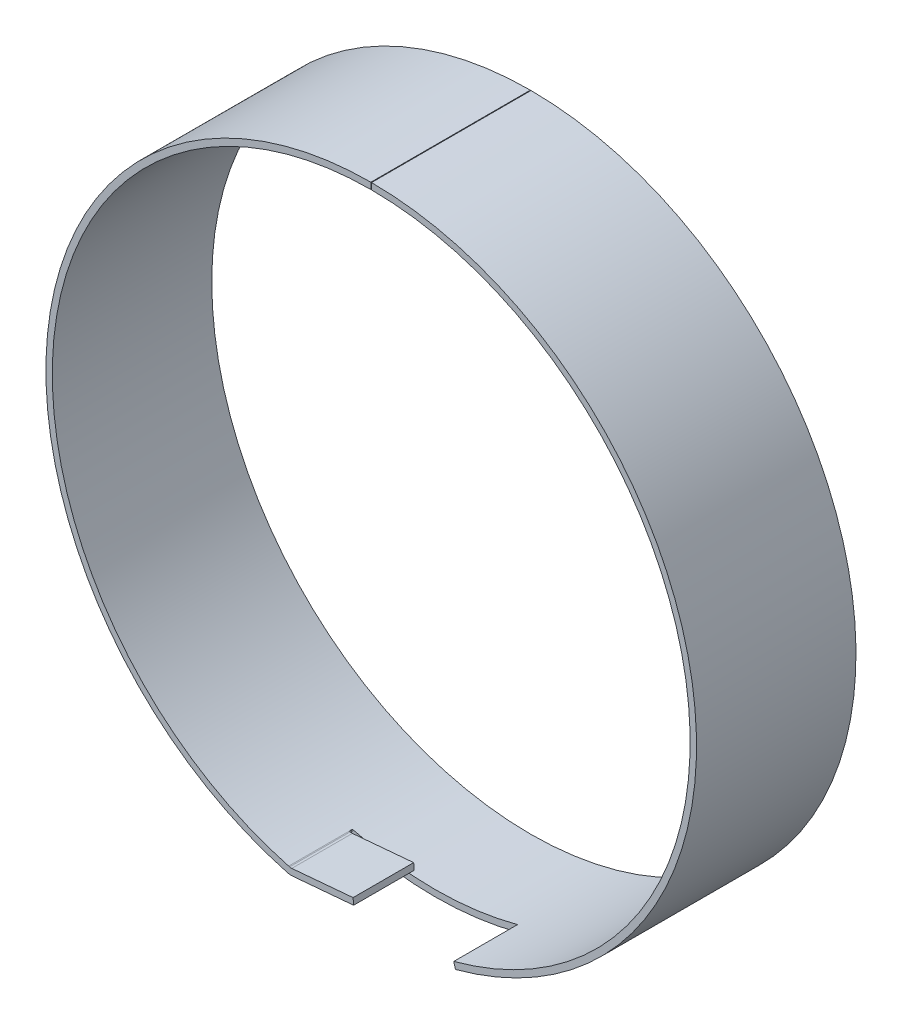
ISO-10303-21;
HEADER;
FILE_DESCRIPTION(('STEP AP214'),'2;1');
FILE_NAME('part.step','',(''),(''),'','','');
FILE_SCHEMA(('AUTOMOTIVE_DESIGN { 1 0 10303 214 1 1 1 1 }'));
ENDSEC;
DATA;
#1=APPLICATION_CONTEXT('core data for automotive mechanical design processes');
#2=APPLICATION_PROTOCOL_DEFINITION('international standard','automotive_design',2000,#1);
#3=PRODUCT_CONTEXT('',#1,'mechanical');
#4=PRODUCT('Part','Part','',(#3));
#5=PRODUCT_RELATED_PRODUCT_CATEGORY('part','',(#4));
#6=PRODUCT_DEFINITION_FORMATION('','',#4);
#7=PRODUCT_DEFINITION_CONTEXT('part definition',#1,'design');
#8=PRODUCT_DEFINITION('design','',#6,#7);
#9=PRODUCT_DEFINITION_SHAPE('','',#8);
#10=(LENGTH_UNIT() NAMED_UNIT(*) SI_UNIT(.MILLI.,.METRE.));
#11=(NAMED_UNIT(*) PLANE_ANGLE_UNIT() SI_UNIT($,.RADIAN.));
#12=(NAMED_UNIT(*) SI_UNIT($,.STERADIAN.) SOLID_ANGLE_UNIT());
#13=UNCERTAINTY_MEASURE_WITH_UNIT(LENGTH_MEASURE(1.E-05),#10,'distance_accuracy_value','');
#14=(GEOMETRIC_REPRESENTATION_CONTEXT(3) GLOBAL_UNCERTAINTY_ASSIGNED_CONTEXT((#13)) GLOBAL_UNIT_ASSIGNED_CONTEXT((#10,
#11,#12)) REPRESENTATION_CONTEXT('',''));
#15=CARTESIAN_POINT('',(0.,0.,0.));
#16=DIRECTION('',(0.,0.,1.));
#17=DIRECTION('',(1.,0.,0.));
#18=AXIS2_PLACEMENT_3D('',#15,#16,#17);
#19=CARTESIAN_POINT('',(0.,0.,50.));
#20=DIRECTION('',(0.,0.,-1.));
#21=DIRECTION('',(-1.,0.,0.));
#22=AXIS2_PLACEMENT_3D('',#19,#20,#21);
#23=CYLINDRICAL_SURFACE('',#22,100.7);
#24=DIRECTION('',(0.,0.,-1.));
#25=VECTOR('',#24,1.);
#26=CARTESIAN_POINT('',(26.0630778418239,-97.2687307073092,50.));
#27=LINE('',#26,#25);
#28=CARTESIAN_POINT('',(26.0630778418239,-97.2687307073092,50.));
#29=VERTEX_POINT('',#28);
#30=CARTESIAN_POINT('',(26.0630778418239,-97.2687307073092,30.));
#31=VERTEX_POINT('',#30);
#32=EDGE_CURVE('E61',#29,#31,#27,.T.);
#33=ORIENTED_EDGE('',*,*,#32,.F.);
#34=CARTESIAN_POINT('',(0.,0.,50.));
#35=DIRECTION('',(0.,0.,-1.));
#36=DIRECTION('',(-1.,0.,0.));
#37=AXIS2_PLACEMENT_3D('',#34,#35,#36);
#38=CIRCLE('',#37,100.7);
#39=CARTESIAN_POINT('',(0.100699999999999,100.699949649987,50.));
#40=VERTEX_POINT('',#39);
#41=EDGE_CURVE('E49',#29,#40,#38,.F.);
#42=ORIENTED_EDGE('',*,*,#41,.T.);
#43=DIRECTION('',(0.,0.,-1.));
#44=VECTOR('',#43,1.);
#45=CARTESIAN_POINT('',(0.100699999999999,100.699949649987,50.));
#46=LINE('',#45,#44);
#47=CARTESIAN_POINT('',(0.100699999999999,100.699949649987,0.));
#48=VERTEX_POINT('',#47);
#49=EDGE_CURVE('E107',#48,#40,#46,.F.);
#50=ORIENTED_EDGE('',*,*,#49,.F.);
#51=CARTESIAN_POINT('',(0.,0.,0.));
#52=DIRECTION('',(0.,0.,-1.));
#53=DIRECTION('',(-1.,0.,0.));
#54=AXIS2_PLACEMENT_3D('',#51,#52,#53);
#55=CIRCLE('',#54,100.7);
#56=CARTESIAN_POINT('',(-0.100699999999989,100.699949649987,0.));
#57=VERTEX_POINT('',#56);
#58=EDGE_CURVE('E111',#57,#48,#55,.F.);
#59=ORIENTED_EDGE('',*,*,#58,.F.);
#60=DIRECTION('',(0.,0.,-1.));
#61=VECTOR('',#60,1.);
#62=CARTESIAN_POINT('',(-0.100699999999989,100.699949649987,50.));
#63=LINE('',#62,#61);
#64=CARTESIAN_POINT('',(-0.100699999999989,100.699949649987,50.));
#65=VERTEX_POINT('',#64);
#66=EDGE_CURVE('E116',#65,#57,#63,.T.);
#67=ORIENTED_EDGE('',*,*,#66,.F.);
#68=CARTESIAN_POINT('',(0.,0.,50.));
#69=DIRECTION('',(0.,0.,-1.));
#70=DIRECTION('',(-1.,0.,0.));
#71=AXIS2_PLACEMENT_3D('',#68,#69,#70);
#72=CIRCLE('',#71,100.7);
#73=CARTESIAN_POINT('',(-26.0630778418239,-97.2687307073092,50.));
#74=VERTEX_POINT('',#73);
#75=EDGE_CURVE('E122',#65,#74,#72,.F.);
#76=ORIENTED_EDGE('',*,*,#75,.T.);
#77=DIRECTION('',(0.,0.,1.));
#78=VECTOR('',#77,1.);
#79=CARTESIAN_POINT('',(-26.0630778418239,-97.2687307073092,31.));
#80=LINE('',#79,#78);
#81=CARTESIAN_POINT('',(-26.0630778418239,-97.2687307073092,31.));
#82=VERTEX_POINT('',#81);
#83=EDGE_CURVE('E104',#82,#74,#80,.T.);
#84=ORIENTED_EDGE('',*,*,#83,.F.);
#85=DIRECTION('',(0.,0.,-1.));
#86=VECTOR('',#85,1.);
#87=CARTESIAN_POINT('',(-26.0630778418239,-97.2687307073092,50.));
#88=LINE('',#87,#86);
#89=CARTESIAN_POINT('',(-26.0630778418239,-97.2687307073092,30.));
#90=VERTEX_POINT('',#89);
#91=EDGE_CURVE('E55',#90,#82,#88,.F.);
#92=ORIENTED_EDGE('',*,*,#91,.F.);
#93=CARTESIAN_POINT('',(0.,0.,30.));
#94=DIRECTION('',(0.,0.,-1.));
#95=DIRECTION('',(-1.,0.,0.));
#96=AXIS2_PLACEMENT_3D('',#93,#94,#95);
#97=CIRCLE('',#96,100.7);
#98=EDGE_CURVE('E13',#90,#31,#97,.F.);
#99=ORIENTED_EDGE('',*,*,#98,.T.);
#100=EDGE_LOOP('',(#33,#42,#50,#59,#67,#76,#84,#92,#99));
#101=FACE_BOUND('',#100,.T.);
#102=ADVANCED_FACE('F46',(#101),#23,.F.);
#103=CARTESIAN_POINT('',(-26.0630778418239,-97.2687307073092,31.));
#104=DIRECTION('',(0.258819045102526,0.965925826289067,0.));
#105=DIRECTION('',(-0.965925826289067,0.258819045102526,0.));
#106=AXIS2_PLACEMENT_3D('',#103,#104,#105);
#107=PLANE('',#106);
#108=DIRECTION('',(-0.965925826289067,0.258819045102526,0.));
#109=VECTOR('',#108,1.);
#110=CARTESIAN_POINT('',(-26.0630778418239,-97.2687307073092,50.));
#111=LINE('',#110,#109);
#112=CARTESIAN_POINT('',(-25.7784271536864,-97.3450026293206,50.));
#113=VERTEX_POINT('',#112);
#114=EDGE_CURVE('E125',#113,#74,#111,.T.);
#115=ORIENTED_EDGE('',*,*,#114,.F.);
#116=DIRECTION('',(0.,0.,1.));
#117=VECTOR('',#116,1.);
#118=CARTESIAN_POINT('',(-25.7784271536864,-97.3450026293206,31.));
#119=LINE('',#118,#117);
#120=CARTESIAN_POINT('',(-25.7784271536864,-97.3450026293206,31.));
#121=VERTEX_POINT('',#120);
#122=EDGE_CURVE('E134',#113,#121,#119,.F.);
#123=ORIENTED_EDGE('',*,*,#122,.T.);
#124=DIRECTION('',(-0.965925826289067,0.258819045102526,0.));
#125=VECTOR('',#124,1.);
#126=CARTESIAN_POINT('',(-26.0630778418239,-97.2687307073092,31.));
#127=LINE('',#126,#125);
#128=EDGE_CURVE('E129',#121,#82,#127,.T.);
#129=ORIENTED_EDGE('',*,*,#128,.T.);
#130=ORIENTED_EDGE('',*,*,#83,.T.);
#131=EDGE_LOOP('',(#115,#123,#129,#130));
#132=FACE_BOUND('',#131,.T.);
#133=ADVANCED_FACE('F163',(#132),#107,.T.);
#134=CARTESIAN_POINT('',(-25.0796157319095,-94.7370028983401,31.));
#135=DIRECTION('',(0.,0.,-1.));
#136=DIRECTION('',(-1.,0.,0.));
#137=AXIS2_PLACEMENT_3D('',#134,#135,#136);
#138=CYLINDRICAL_SURFACE('',#137,2.7);
#139=CARTESIAN_POINT('',(-25.0796157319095,-94.7370028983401,31.));
#140=DIRECTION('',(0.,0.,-1.));
#141=DIRECTION('',(-1.,0.,0.));
#142=AXIS2_PLACEMENT_3D('',#139,#140,#141);
#143=CIRCLE('',#142,2.7);
#144=CARTESIAN_POINT('',(-24.8442952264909,-97.4267285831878,31.));
#145=VERTEX_POINT('',#144);
#146=EDGE_CURVE('E144',#121,#145,#143,.F.);
#147=ORIENTED_EDGE('',*,*,#146,.F.);
#148=ORIENTED_EDGE('',*,*,#122,.F.);
#149=CARTESIAN_POINT('',(-25.0796157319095,-94.7370028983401,50.));
#150=DIRECTION('',(0.,0.,-1.));
#151=DIRECTION('',(-1.,0.,0.));
#152=AXIS2_PLACEMENT_3D('',#149,#150,#151);
#153=CIRCLE('',#152,2.7);
#154=CARTESIAN_POINT('',(-24.8442952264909,-97.4267285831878,50.));
#155=VERTEX_POINT('',#154);
#156=EDGE_CURVE('E130',#155,#113,#153,.T.);
#157=ORIENTED_EDGE('',*,*,#156,.F.);
#158=DIRECTION('',(0.,0.,1.));
#159=VECTOR('',#158,1.);
#160=CARTESIAN_POINT('',(-24.8442952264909,-97.4267285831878,31.));
#161=LINE('',#160,#159);
#162=EDGE_CURVE('E140',#145,#155,#161,.T.);
#163=ORIENTED_EDGE('',*,*,#162,.F.);
#164=EDGE_LOOP('',(#147,#148,#157,#163));
#165=FACE_BOUND('',#164,.T.);
#166=ADVANCED_FACE('F168',(#165),#138,.F.);
#167=CARTESIAN_POINT('',(-25.5469192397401,-97.4882002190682,31.));
#168=DIRECTION('',(-0.0871557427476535,0.996194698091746,0.));
#169=DIRECTION('',(-0.996194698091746,-0.0871557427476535,0.));
#170=AXIS2_PLACEMENT_3D('',#167,#168,#169);
#171=PLANE('',#170);
#172=DIRECTION('',(-0.996194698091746,-0.0871557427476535,0.));
#173=VECTOR('',#172,1.);
#174=CARTESIAN_POINT('',(-25.5469192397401,-97.4882002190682,31.));
#175=LINE('',#174,#173);
#176=CARTESIAN_POINT('',(-5.62302527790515,-95.7450853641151,31.));
#177=VERTEX_POINT('',#176);
#178=EDGE_CURVE('E145',#177,#145,#175,.T.);
#179=ORIENTED_EDGE('',*,*,#178,.T.);
#180=ORIENTED_EDGE('',*,*,#162,.T.);
#181=DIRECTION('',(-0.996194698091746,-0.0871557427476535,0.));
#182=VECTOR('',#181,1.);
#183=CARTESIAN_POINT('',(-25.5469192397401,-97.4882002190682,50.));
#184=LINE('',#183,#182);
#185=CARTESIAN_POINT('',(-5.62302527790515,-95.7450853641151,50.));
#186=VERTEX_POINT('',#185);
#187=EDGE_CURVE('E135',#186,#155,#184,.T.);
#188=ORIENTED_EDGE('',*,*,#187,.F.);
#189=DIRECTION('',(0.,0.,1.));
#190=VECTOR('',#189,1.);
#191=CARTESIAN_POINT('',(-5.62302527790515,-95.7450853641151,31.));
#192=LINE('',#191,#190);
#193=EDGE_CURVE('E139',#177,#186,#192,.T.);
#194=ORIENTED_EDGE('',*,*,#193,.F.);
#195=EDGE_LOOP('',(#179,#180,#188,#194));
#196=FACE_BOUND('',#195,.T.);
#197=ADVANCED_FACE('F47',(#196),#171,.T.);
#198=OPEN_SHELL('',(#102,#133,#166,#197));
#199=SHELL_BASED_SURFACE_MODEL('B2',(#198));
#200=CARTESIAN_POINT('',(0.,0.,50.));
#201=DIRECTION('',(0.,0.,1.));
#202=DIRECTION('',(1.,0.,0.));
#203=AXIS2_PLACEMENT_3D('',#200,#201,#202);
#204=PLANE('',#203);
#205=DIRECTION('',(-0.258819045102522,0.965925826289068,0.));
#206=VECTOR('',#205,1.);
#207=CARTESIAN_POINT('',(0.,0.,50.));
#208=LINE('',#207,#206);
#209=CARTESIAN_POINT('',(26.3995426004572,-98.524434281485,50.));
#210=VERTEX_POINT('',#209);
#211=CARTESIAN_POINT('',(25.8819045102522,-96.5925826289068,50.));
#212=VERTEX_POINT('',#211);
#213=EDGE_CURVE('E375',#210,#212,#208,.T.);
#214=ORIENTED_EDGE('',*,*,#213,.F.);
#215=CARTESIAN_POINT('',(0.,0.,50.));
#216=DIRECTION('',(0.,0.,1.));
#217=DIRECTION('',(1.,0.,0.));
#218=AXIS2_PLACEMENT_3D('',#215,#216,#217);
#219=CIRCLE('',#218,102.);
#220=CARTESIAN_POINT('',(0.0999999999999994,101.99995098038,50.));
#221=VERTEX_POINT('',#220);
#222=EDGE_CURVE('E418',#210,#221,#219,.T.);
#223=ORIENTED_EDGE('',*,*,#222,.T.);
#224=DIRECTION('',(0.,1.,0.));
#225=VECTOR('',#224,1.);
#226=CARTESIAN_POINT('',(0.0999999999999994,0.,50.));
#227=LINE('',#226,#225);
#228=CARTESIAN_POINT('',(0.0999999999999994,99.9999499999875,50.));
#229=VERTEX_POINT('',#228);
#230=EDGE_CURVE('E393',#229,#221,#227,.T.);
#231=ORIENTED_EDGE('',*,*,#230,.F.);
#232=CARTESIAN_POINT('',(0.,0.,50.));
#233=DIRECTION('',(0.,0.,1.));
#234=DIRECTION('',(1.,0.,0.));
#235=AXIS2_PLACEMENT_3D('',#232,#233,#234);
#236=CIRCLE('',#235,100.);
#237=EDGE_CURVE('E411',#212,#229,#236,.T.);
#238=ORIENTED_EDGE('',*,*,#237,.F.);
#239=EDGE_LOOP('',(#214,#223,#231,#238));
#240=FACE_BOUND('',#239,.T.);
#241=ADVANCED_FACE('F223',(#240),#204,.T.);
#242=DIRECTION('',(0.965925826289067,-0.258819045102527,0.));
#243=VECTOR('',#242,1.);
#244=CARTESIAN_POINT('',(-26.3995426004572,-98.524434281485,50.));
#245=LINE('',#244,#243);
#246=CARTESIAN_POINT('',(-26.3995426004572,-98.524434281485,50.));
#247=VERTEX_POINT('',#246);
#248=CARTESIAN_POINT('',(-26.1148919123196,-98.6007062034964,50.));
#249=VERTEX_POINT('',#248);
#250=EDGE_CURVE('E362',#247,#249,#245,.T.);
#251=ORIENTED_EDGE('',*,*,#250,.T.);
#252=CARTESIAN_POINT('',(-25.0796157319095,-94.7370028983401,50.));
#253=DIRECTION('',(0.,0.,1.));
#254=DIRECTION('',(1.,0.,0.));
#255=AXIS2_PLACEMENT_3D('',#252,#253,#254);
#256=CIRCLE('',#255,4.);
#257=CARTESIAN_POINT('',(-24.7309927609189,-98.7217816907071,50.));
#258=VERTEX_POINT('',#257);
#259=EDGE_CURVE('E333',#249,#258,#256,.T.);
#260=ORIENTED_EDGE('',*,*,#259,.T.);
#261=DIRECTION('',(0.996194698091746,0.0871557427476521,0.));
#262=VECTOR('',#261,1.);
#263=CARTESIAN_POINT('',(-25.4336167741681,-98.7832533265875,50.));
#264=LINE('',#263,#262);
#265=CARTESIAN_POINT('',(-5.5097228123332,-97.0401384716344,50.));
#266=VERTEX_POINT('',#265);
#267=EDGE_CURVE('E327',#258,#266,#264,.T.);
#268=ORIENTED_EDGE('',*,*,#267,.T.);
#269=DIRECTION('',(-0.0871557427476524,0.996194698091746,0.));
#270=VECTOR('',#269,1.);
#271=CARTESIAN_POINT('',(-5.5097228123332,-97.0401384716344,50.));
#272=LINE('',#271,#270);
#273=CARTESIAN_POINT('',(-5.68403429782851,-95.0477490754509,50.));
#274=VERTEX_POINT('',#273);
#275=EDGE_CURVE('E332',#266,#274,#272,.T.);
#276=ORIENTED_EDGE('',*,*,#275,.T.);
#277=DIRECTION('',(-0.996194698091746,-0.0871557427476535,0.));
#278=VECTOR('',#277,1.);
#279=CARTESIAN_POINT('',(-25.6079282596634,-96.790863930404,50.));
#280=LINE('',#279,#278);
#281=CARTESIAN_POINT('',(-24.9053042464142,-96.7293922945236,50.));
#282=VERTEX_POINT('',#281);
#283=EDGE_CURVE('E350',#274,#282,#280,.T.);
#284=ORIENTED_EDGE('',*,*,#283,.T.);
#285=CARTESIAN_POINT('',(-25.0796157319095,-94.7370028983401,50.));
#286=DIRECTION('',(0.,0.,1.));
#287=DIRECTION('',(1.,0.,0.));
#288=AXIS2_PLACEMENT_3D('',#285,#286,#287);
#289=CIRCLE('',#288,2.);
#290=CARTESIAN_POINT('',(-25.5972538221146,-96.6688545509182,50.));
#291=VERTEX_POINT('',#290);
#292=EDGE_CURVE('E231',#282,#291,#289,.F.);
#293=ORIENTED_EDGE('',*,*,#292,.T.);
#294=DIRECTION('',(-0.965925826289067,0.258819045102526,0.));
#295=VECTOR('',#294,1.);
#296=CARTESIAN_POINT('',(-25.8819045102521,-96.5925826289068,50.));
#297=LINE('',#296,#295);
#298=CARTESIAN_POINT('',(-25.8819045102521,-96.5925826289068,50.));
#299=VERTEX_POINT('',#298);
#300=EDGE_CURVE('E359',#291,#299,#297,.T.);
#301=ORIENTED_EDGE('',*,*,#300,.T.);
#302=CARTESIAN_POINT('',(-0.0999999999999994,99.9999499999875,50.));
#303=VERTEX_POINT('',#302);
#304=EDGE_CURVE('E412',#303,#299,#236,.T.);
#305=ORIENTED_EDGE('',*,*,#304,.F.);
#306=DIRECTION('',(0.,-1.,0.));
#307=VECTOR('',#306,1.);
#308=CARTESIAN_POINT('',(-0.0999999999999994,0.,50.));
#309=LINE('',#308,#307);
#310=CARTESIAN_POINT('',(-0.0999999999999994,101.99995098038,50.));
#311=VERTEX_POINT('',#310);
#312=EDGE_CURVE('E389',#311,#303,#309,.T.);
#313=ORIENTED_EDGE('',*,*,#312,.F.);
#314=EDGE_CURVE('E419',#311,#247,#219,.T.);
#315=ORIENTED_EDGE('',*,*,#314,.T.);
#316=EDGE_LOOP('',(#251,#260,#268,#276,#284,#293,#301,#305,#313,#315));
#317=FACE_BOUND('',#316,.T.);
#318=ADVANCED_FACE('F330',(#317),#204,.T.);
#319=CARTESIAN_POINT('',(0.,0.,0.));
#320=DIRECTION('',(0.,0.,1.));
#321=DIRECTION('',(1.,0.,0.));
#322=AXIS2_PLACEMENT_3D('',#319,#320,#321);
#323=PLANE('',#322);
#324=CARTESIAN_POINT('',(0.,0.,0.));
#325=DIRECTION('',(0.,0.,1.));
#326=DIRECTION('',(1.,0.,0.));
#327=AXIS2_PLACEMENT_3D('',#324,#325,#326);
#328=CIRCLE('',#327,102.);
#329=CARTESIAN_POINT('',(-0.0999999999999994,101.99995098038,0.));
#330=VERTEX_POINT('',#329);
#331=CARTESIAN_POINT('',(0.0999999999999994,101.99995098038,0.));
#332=VERTEX_POINT('',#331);
#333=EDGE_CURVE('E415',#330,#332,#328,.T.);
#334=ORIENTED_EDGE('',*,*,#333,.F.);
#335=DIRECTION('',(0.,-1.,0.));
#336=VECTOR('',#335,1.);
#337=CARTESIAN_POINT('',(-0.0999999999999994,0.,0.));
#338=LINE('',#337,#336);
#339=CARTESIAN_POINT('',(-0.0999999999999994,99.9999499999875,0.));
#340=VERTEX_POINT('',#339);
#341=EDGE_CURVE('E396',#330,#340,#338,.T.);
#342=ORIENTED_EDGE('',*,*,#341,.T.);
#343=CARTESIAN_POINT('',(0.,0.,0.));
#344=DIRECTION('',(0.,0.,1.));
#345=DIRECTION('',(1.,0.,0.));
#346=AXIS2_PLACEMENT_3D('',#343,#344,#345);
#347=CIRCLE('',#346,100.);
#348=CARTESIAN_POINT('',(0.0999999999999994,99.9999499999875,0.));
#349=VERTEX_POINT('',#348);
#350=EDGE_CURVE('E408',#340,#349,#347,.T.);
#351=ORIENTED_EDGE('',*,*,#350,.T.);
#352=DIRECTION('',(0.,1.,0.));
#353=VECTOR('',#352,1.);
#354=CARTESIAN_POINT('',(0.0999999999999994,0.,0.));
#355=LINE('',#354,#353);
#356=EDGE_CURVE('E399',#349,#332,#355,.T.);
#357=ORIENTED_EDGE('',*,*,#356,.T.);
#358=EDGE_LOOP('',(#334,#342,#351,#357));
#359=FACE_BOUND('',#358,.T.);
#360=ADVANCED_FACE('F486',(#359),#323,.F.);
#361=CARTESIAN_POINT('',(0.,0.,50.));
#362=DIRECTION('',(0.,0.,-1.));
#363=DIRECTION('',(-1.,0.,0.));
#364=AXIS2_PLACEMENT_3D('',#361,#362,#363);
#365=CYLINDRICAL_SURFACE('',#364,102.);
#366=ORIENTED_EDGE('',*,*,#222,.F.);
#367=DIRECTION('',(0.,0.,1.));
#368=VECTOR('',#367,1.);
#369=CARTESIAN_POINT('',(26.3995426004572,-98.524434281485,30.));
#370=LINE('',#369,#368);
#371=CARTESIAN_POINT('',(26.3995426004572,-98.524434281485,30.));
#372=VERTEX_POINT('',#371);
#373=EDGE_CURVE('E387',#372,#210,#370,.T.);
#374=ORIENTED_EDGE('',*,*,#373,.F.);
#375=CARTESIAN_POINT('',(0.,0.,30.));
#376=DIRECTION('',(0.,0.,1.));
#377=DIRECTION('',(1.,0.,0.));
#378=AXIS2_PLACEMENT_3D('',#375,#376,#377);
#379=CIRCLE('',#378,102.);
#380=CARTESIAN_POINT('',(-26.3995426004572,-98.524434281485,30.));
#381=VERTEX_POINT('',#380);
#382=EDGE_CURVE('E383',#381,#372,#379,.T.);
#383=ORIENTED_EDGE('',*,*,#382,.F.);
#384=DIRECTION('',(0.,0.,1.));
#385=VECTOR('',#384,1.);
#386=CARTESIAN_POINT('',(-26.3995426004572,-98.524434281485,30.));
#387=LINE('',#386,#385);
#388=CARTESIAN_POINT('',(-26.3995426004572,-98.524434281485,31.));
#389=VERTEX_POINT('',#388);
#390=EDGE_CURVE('E386',#381,#389,#387,.T.);
#391=ORIENTED_EDGE('',*,*,#390,.T.);
#392=DIRECTION('',(0.,0.,1.));
#393=VECTOR('',#392,1.);
#394=CARTESIAN_POINT('',(-26.3995426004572,-98.524434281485,31.));
#395=LINE('',#394,#393);
#396=EDGE_CURVE('E372',#389,#247,#395,.T.);
#397=ORIENTED_EDGE('',*,*,#396,.T.);
#398=ORIENTED_EDGE('',*,*,#314,.F.);
#399=DIRECTION('',(0.,0.,-1.));
#400=VECTOR('',#399,1.);
#401=CARTESIAN_POINT('',(-0.0999999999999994,101.99995098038,50.));
#402=LINE('',#401,#400);
#403=EDGE_CURVE('E405',#311,#330,#402,.T.);
#404=ORIENTED_EDGE('',*,*,#403,.T.);
#405=ORIENTED_EDGE('',*,*,#333,.T.);
#406=DIRECTION('',(0.,0.,-1.));
#407=VECTOR('',#406,1.);
#408=CARTESIAN_POINT('',(0.0999999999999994,101.99995098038,50.));
#409=LINE('',#408,#407);
#410=EDGE_CURVE('E402',#332,#221,#409,.F.);
#411=ORIENTED_EDGE('',*,*,#410,.T.);
#412=EDGE_LOOP('',(#366,#374,#383,#391,#397,#398,#404,#405,#411));
#413=FACE_BOUND('',#412,.T.);
#414=ADVANCED_FACE('F225',(#413),#365,.T.);
#415=CARTESIAN_POINT('',(0.,0.,50.));
#416=DIRECTION('',(0.,0.,-1.));
#417=DIRECTION('',(-1.,0.,0.));
#418=AXIS2_PLACEMENT_3D('',#415,#416,#417);
#419=CYLINDRICAL_SURFACE('',#418,100.);
#420=DIRECTION('',(0.,0.,-1.));
#421=VECTOR('',#420,1.);
#422=CARTESIAN_POINT('',(25.8819045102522,-96.5925826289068,50.));
#423=LINE('',#422,#421);
#424=CARTESIAN_POINT('',(25.8819045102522,-96.5925826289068,30.));
#425=VERTEX_POINT('',#424);
#426=EDGE_CURVE('E432',#212,#425,#423,.T.);
#427=ORIENTED_EDGE('',*,*,#426,.F.);
#428=ORIENTED_EDGE('',*,*,#237,.T.);
#429=DIRECTION('',(0.,0.,-1.));
#430=VECTOR('',#429,1.);
#431=CARTESIAN_POINT('',(0.0999999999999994,99.9999499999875,50.));
#432=LINE('',#431,#430);
#433=EDGE_CURVE('E421',#349,#229,#432,.F.);
#434=ORIENTED_EDGE('',*,*,#433,.F.);
#435=ORIENTED_EDGE('',*,*,#350,.F.);
#436=DIRECTION('',(0.,0.,-1.));
#437=VECTOR('',#436,1.);
#438=CARTESIAN_POINT('',(-0.0999999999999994,99.9999499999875,50.));
#439=LINE('',#438,#437);
#440=EDGE_CURVE('E424',#303,#340,#439,.T.);
#441=ORIENTED_EDGE('',*,*,#440,.F.);
#442=ORIENTED_EDGE('',*,*,#304,.T.);
#443=DIRECTION('',(0.,0.,1.));
#444=VECTOR('',#443,1.);
#445=CARTESIAN_POINT('',(-25.8819045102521,-96.5925826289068,31.));
#446=LINE('',#445,#444);
#447=CARTESIAN_POINT('',(-25.8819045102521,-96.5925826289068,31.));
#448=VERTEX_POINT('',#447);
#449=EDGE_CURVE('E371',#448,#299,#446,.T.);
#450=ORIENTED_EDGE('',*,*,#449,.F.);
#451=DIRECTION('',(0.,0.,-1.));
#452=VECTOR('',#451,1.);
#453=CARTESIAN_POINT('',(-25.8819045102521,-96.5925826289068,50.));
#454=LINE('',#453,#452);
#455=CARTESIAN_POINT('',(-25.8819045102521,-96.5925826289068,30.));
#456=VERTEX_POINT('',#455);
#457=EDGE_CURVE('E429',#456,#448,#454,.F.);
#458=ORIENTED_EDGE('',*,*,#457,.F.);
#459=CARTESIAN_POINT('',(0.,0.,30.));
#460=DIRECTION('',(0.,0.,1.));
#461=DIRECTION('',(1.,0.,0.));
#462=AXIS2_PLACEMENT_3D('',#459,#460,#461);
#463=CIRCLE('',#462,100.);
#464=EDGE_CURVE('E426',#456,#425,#463,.T.);
#465=ORIENTED_EDGE('',*,*,#464,.T.);
#466=EDGE_LOOP('',(#427,#428,#434,#435,#441,#442,#450,#458,#465));
#467=FACE_BOUND('',#466,.T.);
#468=ADVANCED_FACE('F462',(#467),#419,.F.);
#469=CARTESIAN_POINT('',(0.0999999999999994,0.,0.));
#470=DIRECTION('',(1.,0.,0.));
#471=DIRECTION('',(0.,0.,-1.));
#472=AXIS2_PLACEMENT_3D('',#469,#470,#471);
#473=PLANE('',#472);
#474=ORIENTED_EDGE('',*,*,#356,.F.);
#475=ORIENTED_EDGE('',*,*,#433,.T.);
#476=ORIENTED_EDGE('',*,*,#230,.T.);
#477=ORIENTED_EDGE('',*,*,#410,.F.);
#478=EDGE_LOOP('',(#474,#475,#476,#477));
#479=FACE_BOUND('',#478,.T.);
#480=ADVANCED_FACE('F481',(#479),#473,.F.);
#481=CARTESIAN_POINT('',(-0.0999999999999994,0.,0.));
#482=DIRECTION('',(-1.,0.,0.));
#483=DIRECTION('',(0.,0.,1.));
#484=AXIS2_PLACEMENT_3D('',#481,#482,#483);
#485=PLANE('',#484);
#486=ORIENTED_EDGE('',*,*,#312,.T.);
#487=ORIENTED_EDGE('',*,*,#440,.T.);
#488=ORIENTED_EDGE('',*,*,#341,.F.);
#489=ORIENTED_EDGE('',*,*,#403,.F.);
#490=EDGE_LOOP('',(#486,#487,#488,#489));
#491=FACE_BOUND('',#490,.T.);
#492=ADVANCED_FACE('F519',(#491),#485,.F.);
#493=CARTESIAN_POINT('',(0.,0.,30.));
#494=DIRECTION('',(0.965925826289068,0.258819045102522,0.));
#495=DIRECTION('',(-0.258819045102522,0.965925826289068,0.));
#496=AXIS2_PLACEMENT_3D('',#493,#494,#495);
#497=PLANE('',#496);
#498=ORIENTED_EDGE('',*,*,#426,.T.);
#499=DIRECTION('',(-0.258819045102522,0.965925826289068,0.));
#500=VECTOR('',#499,1.);
#501=CARTESIAN_POINT('',(0.,0.,30.));
#502=LINE('',#501,#500);
#503=EDGE_CURVE('E379',#372,#425,#502,.T.);
#504=ORIENTED_EDGE('',*,*,#503,.F.);
#505=ORIENTED_EDGE('',*,*,#373,.T.);
#506=ORIENTED_EDGE('',*,*,#213,.T.);
#507=EDGE_LOOP('',(#498,#504,#505,#506));
#508=FACE_BOUND('',#507,.T.);
#509=ADVANCED_FACE('F521',(#508),#497,.F.);
#510=CARTESIAN_POINT('',(0.,0.,30.));
#511=DIRECTION('',(-0.965925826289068,0.258819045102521,0.));
#512=DIRECTION('',(-0.258819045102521,-0.965925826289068,0.));
#513=AXIS2_PLACEMENT_3D('',#510,#511,#512);
#514=PLANE('',#513);
#515=ORIENTED_EDGE('',*,*,#457,.T.);
#516=DIRECTION('',(-0.25881904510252,-0.965925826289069,0.));
#517=VECTOR('',#516,1.);
#518=CARTESIAN_POINT('',(-25.8819045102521,-96.5925826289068,31.));
#519=LINE('',#518,#517);
#520=EDGE_CURVE('E366',#448,#389,#519,.T.);
#521=ORIENTED_EDGE('',*,*,#520,.T.);
#522=ORIENTED_EDGE('',*,*,#390,.F.);
#523=DIRECTION('',(-0.258819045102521,-0.965925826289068,0.));
#524=VECTOR('',#523,1.);
#525=CARTESIAN_POINT('',(0.,0.,30.));
#526=LINE('',#525,#524);
#527=EDGE_CURVE('E381',#456,#381,#526,.T.);
#528=ORIENTED_EDGE('',*,*,#527,.F.);
#529=EDGE_LOOP('',(#515,#521,#522,#528));
#530=FACE_BOUND('',#529,.T.);
#531=ADVANCED_FACE('F467',(#530),#514,.F.);
#532=CARTESIAN_POINT('',(0.,0.,30.));
#533=DIRECTION('',(0.,0.,1.));
#534=DIRECTION('',(1.,0.,0.));
#535=AXIS2_PLACEMENT_3D('',#532,#533,#534);
#536=PLANE('',#535);
#537=ORIENTED_EDGE('',*,*,#527,.T.);
#538=ORIENTED_EDGE('',*,*,#382,.T.);
#539=ORIENTED_EDGE('',*,*,#503,.T.);
#540=ORIENTED_EDGE('',*,*,#464,.F.);
#541=EDGE_LOOP('',(#537,#538,#539,#540));
#542=FACE_BOUND('',#541,.T.);
#543=ADVANCED_FACE('F471',(#542),#536,.T.);
#544=CARTESIAN_POINT('',(-25.8819045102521,-96.5925826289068,31.));
#545=DIRECTION('',(0.258819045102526,0.965925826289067,0.));
#546=DIRECTION('',(-0.965925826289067,0.258819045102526,0.));
#547=AXIS2_PLACEMENT_3D('',#544,#545,#546);
#548=PLANE('',#547);
#549=ORIENTED_EDGE('',*,*,#300,.F.);
#550=DIRECTION('',(0.,0.,1.));
#551=VECTOR('',#550,1.);
#552=CARTESIAN_POINT('',(-25.5972538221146,-96.6688545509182,31.));
#553=LINE('',#552,#551);
#554=CARTESIAN_POINT('',(-25.5972538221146,-96.6688545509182,31.));
#555=VERTEX_POINT('',#554);
#556=EDGE_CURVE('E244',#291,#555,#553,.F.);
#557=ORIENTED_EDGE('',*,*,#556,.T.);
#558=DIRECTION('',(-0.965925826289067,0.258819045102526,0.));
#559=VECTOR('',#558,1.);
#560=CARTESIAN_POINT('',(-25.8819045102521,-96.5925826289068,31.));
#561=LINE('',#560,#559);
#562=EDGE_CURVE('E364',#555,#448,#561,.T.);
#563=ORIENTED_EDGE('',*,*,#562,.T.);
#564=ORIENTED_EDGE('',*,*,#449,.T.);
#565=EDGE_LOOP('',(#549,#557,#563,#564));
#566=FACE_BOUND('',#565,.T.);
#567=ADVANCED_FACE('F458',(#566),#548,.T.);
#568=CARTESIAN_POINT('',(-26.3995426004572,-98.524434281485,31.));
#569=DIRECTION('',(-0.258819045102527,-0.965925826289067,0.));
#570=DIRECTION('',(0.965925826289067,-0.258819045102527,0.));
#571=AXIS2_PLACEMENT_3D('',#568,#569,#570);
#572=PLANE('',#571);
#573=DIRECTION('',(0.965925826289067,-0.258819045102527,0.));
#574=VECTOR('',#573,1.);
#575=CARTESIAN_POINT('',(-26.3995426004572,-98.524434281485,31.));
#576=LINE('',#575,#574);
#577=CARTESIAN_POINT('',(-26.1148919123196,-98.6007062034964,31.));
#578=VERTEX_POINT('',#577);
#579=EDGE_CURVE('E368',#389,#578,#576,.T.);
#580=ORIENTED_EDGE('',*,*,#579,.T.);
#581=DIRECTION('',(0.,0.,1.));
#582=VECTOR('',#581,1.);
#583=CARTESIAN_POINT('',(-26.1148919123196,-98.6007062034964,31.));
#584=LINE('',#583,#582);
#585=EDGE_CURVE('E435',#578,#249,#584,.T.);
#586=ORIENTED_EDGE('',*,*,#585,.T.);
#587=ORIENTED_EDGE('',*,*,#250,.F.);
#588=ORIENTED_EDGE('',*,*,#396,.F.);
#589=EDGE_LOOP('',(#580,#586,#587,#588));
#590=FACE_BOUND('',#589,.T.);
#591=ADVANCED_FACE('F493',(#590),#572,.T.);
#592=CARTESIAN_POINT('',(-24.9159786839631,-96.8514016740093,31.));
#593=DIRECTION('',(0.,0.,-1.));
#594=DIRECTION('',(-1.,0.,0.));
#595=AXIS2_PLACEMENT_3D('',#592,#593,#594);
#596=PLANE('',#595);
#597=DIRECTION('',(0.996194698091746,0.0871557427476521,0.));
#598=VECTOR('',#597,1.);
#599=CARTESIAN_POINT('',(-25.4336167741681,-98.7832533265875,31.));
#600=LINE('',#599,#598);
#601=CARTESIAN_POINT('',(-24.7309927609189,-98.7217816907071,31.));
#602=VERTEX_POINT('',#601);
#603=CARTESIAN_POINT('',(-5.5097228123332,-97.0401384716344,31.));
#604=VERTEX_POINT('',#603);
#605=EDGE_CURVE('E341',#602,#604,#600,.T.);
#606=ORIENTED_EDGE('',*,*,#605,.F.);
#607=CARTESIAN_POINT('',(-25.0796157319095,-94.7370028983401,31.));
#608=DIRECTION('',(0.,0.,-1.));
#609=DIRECTION('',(-1.,0.,0.));
#610=AXIS2_PLACEMENT_3D('',#607,#608,#609);
#611=CIRCLE('',#610,4.);
#612=EDGE_CURVE('E441',#602,#578,#611,.T.);
#613=ORIENTED_EDGE('',*,*,#612,.T.);
#614=ORIENTED_EDGE('',*,*,#579,.F.);
#615=ORIENTED_EDGE('',*,*,#520,.F.);
#616=ORIENTED_EDGE('',*,*,#562,.F.);
#617=CARTESIAN_POINT('',(-25.0796157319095,-94.7370028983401,31.));
#618=DIRECTION('',(0.,0.,-1.));
#619=DIRECTION('',(-1.,0.,0.));
#620=AXIS2_PLACEMENT_3D('',#617,#618,#619);
#621=CIRCLE('',#620,2.);
#622=CARTESIAN_POINT('',(-24.9053042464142,-96.7293922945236,31.));
#623=VERTEX_POINT('',#622);
#624=EDGE_CURVE('E44',#555,#623,#621,.F.);
#625=ORIENTED_EDGE('',*,*,#624,.T.);
#626=DIRECTION('',(-0.996194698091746,-0.0871557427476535,0.));
#627=VECTOR('',#626,1.);
#628=CARTESIAN_POINT('',(-25.6079282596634,-96.790863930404,31.));
#629=LINE('',#628,#627);
#630=CARTESIAN_POINT('',(-5.68403429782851,-95.0477490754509,31.));
#631=VERTEX_POINT('',#630);
#632=EDGE_CURVE('E346',#631,#623,#629,.T.);
#633=ORIENTED_EDGE('',*,*,#632,.F.);
#634=DIRECTION('',(-0.0871557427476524,0.996194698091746,0.));
#635=VECTOR('',#634,1.);
#636=CARTESIAN_POINT('',(-5.5097228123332,-97.0401384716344,31.));
#637=LINE('',#636,#635);
#638=EDGE_CURVE('E355',#604,#631,#637,.T.);
#639=ORIENTED_EDGE('',*,*,#638,.F.);
#640=EDGE_LOOP('',(#606,#613,#614,#615,#616,#625,#633,#639));
#641=FACE_BOUND('',#640,.T.);
#642=ADVANCED_FACE('F454',(#641),#596,.T.);
#643=CARTESIAN_POINT('',(-25.4336167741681,-98.7832533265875,31.));
#644=DIRECTION('',(0.0871557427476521,-0.996194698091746,0.));
#645=DIRECTION('',(0.996194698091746,0.0871557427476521,0.));
#646=AXIS2_PLACEMENT_3D('',#643,#644,#645);
#647=PLANE('',#646);
#648=ORIENTED_EDGE('',*,*,#267,.F.);
#649=DIRECTION('',(0.,0.,1.));
#650=VECTOR('',#649,1.);
#651=CARTESIAN_POINT('',(-24.7309927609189,-98.7217816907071,31.));
#652=LINE('',#651,#650);
#653=EDGE_CURVE('E439',#258,#602,#652,.F.);
#654=ORIENTED_EDGE('',*,*,#653,.T.);
#655=ORIENTED_EDGE('',*,*,#605,.T.);
#656=DIRECTION('',(0.,0.,1.));
#657=VECTOR('',#656,1.);
#658=CARTESIAN_POINT('',(-5.5097228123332,-97.0401384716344,31.));
#659=LINE('',#658,#657);
#660=EDGE_CURVE('E338',#604,#266,#659,.T.);
#661=ORIENTED_EDGE('',*,*,#660,.T.);
#662=EDGE_LOOP('',(#648,#654,#655,#661));
#663=FACE_BOUND('',#662,.T.);
#664=ADVANCED_FACE('F339',(#663),#647,.T.);
#665=CARTESIAN_POINT('',(-25.6079282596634,-96.790863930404,31.));
#666=DIRECTION('',(-0.0871557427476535,0.996194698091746,0.));
#667=DIRECTION('',(-0.996194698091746,-0.0871557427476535,0.));
#668=AXIS2_PLACEMENT_3D('',#665,#666,#667);
#669=PLANE('',#668);
#670=ORIENTED_EDGE('',*,*,#632,.T.);
#671=DIRECTION('',(0.,0.,1.));
#672=VECTOR('',#671,1.);
#673=CARTESIAN_POINT('',(-24.9053042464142,-96.7293922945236,50.));
#674=LINE('',#673,#672);
#675=EDGE_CURVE('E443',#623,#282,#674,.T.);
#676=ORIENTED_EDGE('',*,*,#675,.T.);
#677=ORIENTED_EDGE('',*,*,#283,.F.);
#678=DIRECTION('',(0.,0.,1.));
#679=VECTOR('',#678,1.);
#680=CARTESIAN_POINT('',(-5.68403429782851,-95.0477490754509,31.));
#681=LINE('',#680,#679);
#682=EDGE_CURVE('E345',#631,#274,#681,.T.);
#683=ORIENTED_EDGE('',*,*,#682,.F.);
#684=EDGE_LOOP('',(#670,#676,#677,#683));
#685=FACE_BOUND('',#684,.T.);
#686=ADVANCED_FACE('F448',(#685),#669,.T.);
#687=CARTESIAN_POINT('',(-5.5097228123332,-97.0401384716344,31.));
#688=DIRECTION('',(0.996194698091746,0.0871557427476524,0.));
#689=DIRECTION('',(-0.0871557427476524,0.996194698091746,0.));
#690=AXIS2_PLACEMENT_3D('',#687,#688,#689);
#691=PLANE('',#690);
#692=ORIENTED_EDGE('',*,*,#275,.F.);
#693=ORIENTED_EDGE('',*,*,#660,.F.);
#694=ORIENTED_EDGE('',*,*,#638,.T.);
#695=ORIENTED_EDGE('',*,*,#682,.T.);
#696=EDGE_LOOP('',(#692,#693,#694,#695));
#697=FACE_BOUND('',#696,.T.);
#698=ADVANCED_FACE('F348',(#697),#691,.T.);
#699=CARTESIAN_POINT('',(-25.0796157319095,-94.7370028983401,31.));
#700=DIRECTION('',(0.,0.,1.));
#701=DIRECTION('',(1.,0.,0.));
#702=AXIS2_PLACEMENT_3D('',#699,#700,#701);
#703=CYLINDRICAL_SURFACE('',#702,4.);
#704=ORIENTED_EDGE('',*,*,#612,.F.);
#705=ORIENTED_EDGE('',*,*,#653,.F.);
#706=ORIENTED_EDGE('',*,*,#259,.F.);
#707=ORIENTED_EDGE('',*,*,#585,.F.);
#708=EDGE_LOOP('',(#704,#705,#706,#707));
#709=FACE_BOUND('',#708,.T.);
#710=ADVANCED_FACE('F497',(#709),#703,.T.);
#711=CARTESIAN_POINT('',(-25.0796157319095,-94.7370028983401,31.));
#712=DIRECTION('',(0.,0.,-1.));
#713=DIRECTION('',(-1.,0.,0.));
#714=AXIS2_PLACEMENT_3D('',#711,#712,#713);
#715=CYLINDRICAL_SURFACE('',#714,2.);
#716=ORIENTED_EDGE('',*,*,#624,.F.);
#717=ORIENTED_EDGE('',*,*,#556,.F.);
#718=ORIENTED_EDGE('',*,*,#292,.F.);
#719=ORIENTED_EDGE('',*,*,#675,.F.);
#720=EDGE_LOOP('',(#716,#717,#718,#719));
#721=FACE_BOUND('',#720,.T.);
#722=ADVANCED_FACE('F452',(#721),#715,.F.);
#723=CLOSED_SHELL('',(#241,#318,#360,#414,#468,#480,#492,#509,#531,#543,#567,#591,#642,#664,
#686,#698,#710,#722));
#724=MANIFOLD_SOLID_BREP('B7',#723);
#725=ADVANCED_BREP_SHAPE_REPRESENTATION('',(#18,#724),#14);
#726=MANIFOLD_SURFACE_SHAPE_REPRESENTATION('',(#18,#199),#14);
#727=SHAPE_REPRESENTATION('',(#18),#14);
#728=SHAPE_DEFINITION_REPRESENTATION(#9,#727);
#729=SHAPE_REPRESENTATION_RELATIONSHIP('','',#727,#725);
#730=SHAPE_REPRESENTATION_RELATIONSHIP('','',#727,#726);
ENDSEC;
END-ISO-10303-21;
